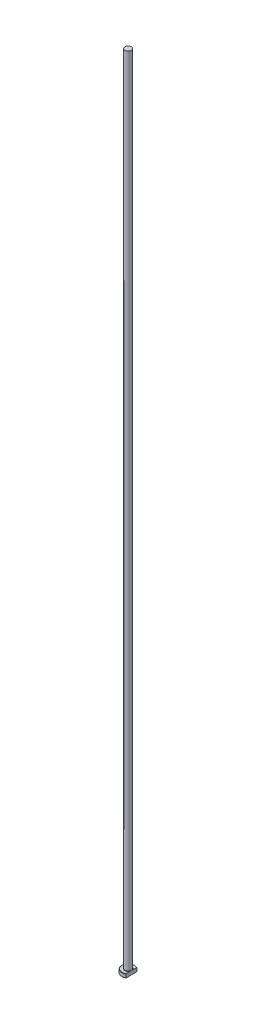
ISO-10303-21;
HEADER;
FILE_DESCRIPTION(('STEP AP214'),'2;1');
FILE_NAME('part.step','',(''),(''),'','','');
FILE_SCHEMA(('AUTOMOTIVE_DESIGN { 1 0 10303 214 1 1 1 1 }'));
ENDSEC;
DATA;
#1=APPLICATION_CONTEXT('core data for automotive mechanical design processes');
#2=APPLICATION_PROTOCOL_DEFINITION('international standard','automotive_design',2000,#1);
#3=PRODUCT_CONTEXT('',#1,'mechanical');
#4=PRODUCT('Part','Part','',(#3));
#5=PRODUCT_RELATED_PRODUCT_CATEGORY('part','',(#4));
#6=PRODUCT_DEFINITION_FORMATION('','',#4);
#7=PRODUCT_DEFINITION_CONTEXT('part definition',#1,'design');
#8=PRODUCT_DEFINITION('design','',#6,#7);
#9=PRODUCT_DEFINITION_SHAPE('','',#8);
#10=(LENGTH_UNIT() NAMED_UNIT(*) SI_UNIT(.MILLI.,.METRE.));
#11=(NAMED_UNIT(*) PLANE_ANGLE_UNIT() SI_UNIT($,.RADIAN.));
#12=(NAMED_UNIT(*) SI_UNIT($,.STERADIAN.) SOLID_ANGLE_UNIT());
#13=UNCERTAINTY_MEASURE_WITH_UNIT(LENGTH_MEASURE(1.E-05),#10,'distance_accuracy_value','');
#14=(GEOMETRIC_REPRESENTATION_CONTEXT(3) GLOBAL_UNCERTAINTY_ASSIGNED_CONTEXT((#13)) GLOBAL_UNIT_ASSIGNED_CONTEXT((#10,
#11,#12)) REPRESENTATION_CONTEXT('',''));
#15=CARTESIAN_POINT('',(0.,0.,0.));
#16=DIRECTION('',(0.,0.,1.));
#17=DIRECTION('',(1.,0.,0.));
#18=AXIS2_PLACEMENT_3D('',#15,#16,#17);
#19=CARTESIAN_POINT('',(0.,0.,0.));
#20=DIRECTION('',(0.,-1.,0.));
#21=DIRECTION('',(0.,0.,-1.));
#22=AXIS2_PLACEMENT_3D('',#19,#20,#21);
#23=PLANE('',#22);
#24=CARTESIAN_POINT('',(0.,0.,0.));
#25=DIRECTION('',(0.,-1.,0.));
#26=DIRECTION('',(0.,0.,-1.));
#27=AXIS2_PLACEMENT_3D('',#24,#25,#26);
#28=CIRCLE('',#27,4.79999999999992);
#29=CARTESIAN_POINT('',(2.49999999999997,0.,4.0975602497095));
#30=VERTEX_POINT('',#29);
#31=CARTESIAN_POINT('',(2.49999999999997,0.,-4.0975602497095));
#32=VERTEX_POINT('',#31);
#33=EDGE_CURVE('E98',#30,#32,#28,.T.);
#34=ORIENTED_EDGE('',*,*,#33,.T.);
#35=DIRECTION('',(0.,0.,1.));
#36=VECTOR('',#35,1.);
#37=CARTESIAN_POINT('',(2.49999999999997,0.,-4.33012701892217));
#38=LINE('',#37,#36);
#39=EDGE_CURVE('E83',#32,#30,#38,.T.);
#40=ORIENTED_EDGE('',*,*,#39,.T.);
#41=EDGE_LOOP('',(#34,#40));
#42=FACE_BOUND('',#41,.T.);
#43=ADVANCED_FACE('F32',(#42),#23,.T.);
#44=CARTESIAN_POINT('',(0.,259.958771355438,0.));
#45=DIRECTION('',(0.,1.,0.));
#46=DIRECTION('',(0.,0.,1.));
#47=AXIS2_PLACEMENT_3D('',#44,#45,#46);
#48=CYLINDRICAL_SURFACE('',#47,4.99999999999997);
#49=CARTESIAN_POINT('',(0.,2.79999999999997,0.));
#50=DIRECTION('',(0.,1.,0.));
#51=DIRECTION('',(0.,0.,1.));
#52=AXIS2_PLACEMENT_3D('',#49,#50,#51);
#53=CIRCLE('',#52,4.99999999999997);
#54=CARTESIAN_POINT('',(2.49999999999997,2.79999999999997,4.33012701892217));
#55=VERTEX_POINT('',#54);
#56=CARTESIAN_POINT('',(2.49999999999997,2.79999999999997,-4.33012701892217));
#57=VERTEX_POINT('',#56);
#58=EDGE_CURVE('E104',#55,#57,#53,.F.);
#59=ORIENTED_EDGE('',*,*,#58,.T.);
#60=DIRECTION('',(0.,-1.,0.));
#61=VECTOR('',#60,1.);
#62=CARTESIAN_POINT('',(2.49999999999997,630.,-4.33012701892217));
#63=LINE('',#62,#61);
#64=CARTESIAN_POINT('',(2.49999999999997,0.200000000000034,-4.33012701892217));
#65=VERTEX_POINT('',#64);
#66=EDGE_CURVE('E183',#57,#65,#63,.T.);
#67=ORIENTED_EDGE('',*,*,#66,.T.);
#68=CARTESIAN_POINT('',(0.,0.200000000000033,0.));
#69=DIRECTION('',(0.,-1.,0.));
#70=DIRECTION('',(0.,0.,-1.));
#71=AXIS2_PLACEMENT_3D('',#68,#69,#70);
#72=CIRCLE('',#71,4.99999999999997);
#73=CARTESIAN_POINT('',(2.49999999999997,0.200000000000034,4.33012701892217));
#74=VERTEX_POINT('',#73);
#75=EDGE_CURVE('E100',#65,#74,#72,.F.);
#76=ORIENTED_EDGE('',*,*,#75,.T.);
#77=DIRECTION('',(0.,-1.,0.));
#78=VECTOR('',#77,1.);
#79=CARTESIAN_POINT('',(2.49999999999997,630.,4.33012701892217));
#80=LINE('',#79,#78);
#81=EDGE_CURVE('E93',#55,#74,#80,.T.);
#82=ORIENTED_EDGE('',*,*,#81,.F.);
#83=EDGE_LOOP('',(#59,#67,#76,#82));
#84=FACE_BOUND('',#83,.T.);
#85=ADVANCED_FACE('F158',(#84),#48,.T.);
#86=CARTESIAN_POINT('',(-4.99999999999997,3.,0.));
#87=DIRECTION('',(0.,1.,0.));
#88=DIRECTION('',(0.,0.,1.));
#89=AXIS2_PLACEMENT_3D('',#86,#87,#88);
#90=PLANE('',#89);
#91=CARTESIAN_POINT('',(0.,3.,0.));
#92=DIRECTION('',(0.,1.,0.));
#93=DIRECTION('',(0.,0.,1.));
#94=AXIS2_PLACEMENT_3D('',#91,#92,#93);
#95=CIRCLE('',#94,4.79999999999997);
#96=CARTESIAN_POINT('',(2.49999999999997,3.,-4.09756024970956));
#97=VERTEX_POINT('',#96);
#98=CARTESIAN_POINT('',(2.49999999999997,3.,4.09756024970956));
#99=VERTEX_POINT('',#98);
#100=EDGE_CURVE('E178',#97,#99,#95,.T.);
#101=ORIENTED_EDGE('',*,*,#100,.T.);
#102=DIRECTION('',(0.,0.,-1.));
#103=VECTOR('',#102,1.);
#104=CARTESIAN_POINT('',(2.49999999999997,3.,0.));
#105=LINE('',#104,#103);
#106=CARTESIAN_POINT('',(2.49999999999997,2.99999999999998,1.01980390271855));
#107=VERTEX_POINT('',#106);
#108=EDGE_CURVE('E57',#99,#107,#105,.T.);
#109=ORIENTED_EDGE('',*,*,#108,.T.);
#110=CARTESIAN_POINT('',(0.,3.,0.));
#111=DIRECTION('',(0.,1.,0.));
#112=DIRECTION('',(0.,0.,1.));
#113=AXIS2_PLACEMENT_3D('',#110,#111,#112);
#114=CIRCLE('',#113,2.69999999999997);
#115=CARTESIAN_POINT('',(2.49999999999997,2.99999999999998,-1.01980390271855));
#116=VERTEX_POINT('',#115);
#117=EDGE_CURVE('E107',#107,#116,#114,.F.);
#118=ORIENTED_EDGE('',*,*,#117,.T.);
#119=EDGE_CURVE('E136',#116,#97,#105,.T.);
#120=ORIENTED_EDGE('',*,*,#119,.T.);
#121=EDGE_LOOP('',(#101,#109,#118,#120));
#122=FACE_BOUND('',#121,.T.);
#123=ADVANCED_FACE('F147',(#122),#90,.T.);
#124=CARTESIAN_POINT('',(0.,3.,0.));
#125=DIRECTION('',(0.,-1.,0.));
#126=DIRECTION('',(0.,0.,-1.));
#127=AXIS2_PLACEMENT_3D('',#124,#125,#126);
#128=CONICAL_SURFACE('',#127,4.79999999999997,0.785398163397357);
#129=ORIENTED_EDGE('',*,*,#58,.F.);
#130=CARTESIAN_POINT('',(2.49999999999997,-2.05039133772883,9.52786489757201));
#131=CARTESIAN_POINT('',(2.49999999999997,-1.84160367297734,9.31199733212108));
#132=CARTESIAN_POINT('',(2.49999999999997,-1.63304008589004,9.0959123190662));
#133=CARTESIAN_POINT('',(2.49999999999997,-1.21649358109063,8.66317810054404));
#134=CARTESIAN_POINT('',(2.49999999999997,-1.00851067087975,8.44652888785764));
#135=CARTESIAN_POINT('',(2.49999999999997,-0.593157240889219,8.01243155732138));
#136=CARTESIAN_POINT('',(2.49999999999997,-0.385787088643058,7.7949830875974));
#137=CARTESIAN_POINT('',(2.49999999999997,0.0280365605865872,7.35921771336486));
#138=CARTESIAN_POINT('',(2.49999999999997,0.234490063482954,7.1409008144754));
#139=CARTESIAN_POINT('',(2.49999999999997,0.642130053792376,6.70748960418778));
#140=CARTESIAN_POINT('',(2.49999999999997,0.843339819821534,6.49241720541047));
#141=CARTESIAN_POINT('',(2.49999999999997,1.24425381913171,6.06087422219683));
#142=CARTESIAN_POINT('',(2.49999999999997,1.44395806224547,5.84440364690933));
#143=CARTESIAN_POINT('',(2.49999999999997,1.84127751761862,5.40963663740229));
#144=CARTESIAN_POINT('',(2.49999999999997,2.03889317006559,5.19134060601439));
#145=CARTESIAN_POINT('',(2.49999999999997,2.43125043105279,4.7521850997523));
#146=CARTESIAN_POINT('',(2.49999999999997,2.6259921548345,4.53132572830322));
#147=CARTESIAN_POINT('',(2.49999999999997,2.93693788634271,4.17181619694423));
#148=CARTESIAN_POINT('',(2.49999999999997,3.05446493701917,4.03431188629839));
#149=CARTESIAN_POINT('',(2.49999999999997,3.28742704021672,3.75751486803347));
#150=CARTESIAN_POINT('',(2.49999999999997,3.40286188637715,3.6182219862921));
#151=CARTESIAN_POINT('',(2.49999999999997,3.63213234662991,3.33586492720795));
#152=CARTESIAN_POINT('',(2.49999999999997,3.74593818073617,3.19277645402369));
#153=CARTESIAN_POINT('',(2.49999999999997,3.96956266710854,2.90356071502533));
#154=CARTESIAN_POINT('',(2.49999999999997,4.079382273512,2.75743418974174));
#155=CARTESIAN_POINT('',(2.49999999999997,4.29502410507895,2.45881038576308));
#156=CARTESIAN_POINT('',(2.49999999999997,4.40076032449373,2.30625006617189));
#157=CARTESIAN_POINT('',(2.49999999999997,4.55286945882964,2.07299325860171));
#158=CARTESIAN_POINT('',(2.49999999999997,4.60252613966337,1.99444197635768));
#159=CARTESIAN_POINT('',(2.49999999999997,4.69908164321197,1.83566827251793));
#160=CARTESIAN_POINT('',(2.49999999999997,4.74598077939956,1.75544604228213));
#161=CARTESIAN_POINT('',(2.49999999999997,4.83578466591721,1.59405362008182));
#162=CARTESIAN_POINT('',(2.49999999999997,4.87873126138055,1.51290702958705));
#163=CARTESIAN_POINT('',(2.49999999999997,4.96038600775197,1.34852090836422));
#164=CARTESIAN_POINT('',(2.49999999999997,4.99909338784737,1.26528100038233));
#165=CARTESIAN_POINT('',(2.49999999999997,5.10703093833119,1.01251774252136));
#166=CARTESIAN_POINT('',(2.49999999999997,5.16843307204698,0.839342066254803));
#167=CARTESIAN_POINT('',(2.49999999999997,5.23490554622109,0.579703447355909));
#168=CARTESIAN_POINT('',(2.49999999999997,5.25253806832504,0.496421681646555));
#169=CARTESIAN_POINT('',(2.49999999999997,5.27986337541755,0.328535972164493));
#170=CARTESIAN_POINT('',(2.49999999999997,5.28955686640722,0.243932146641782));
#171=CARTESIAN_POINT('',(2.49999999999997,5.30031768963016,0.0744340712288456));
#172=CARTESIAN_POINT('',(2.49999999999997,5.30141176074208,-0.010458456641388));
#173=CARTESIAN_POINT('',(2.49999999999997,5.29496530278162,-0.179916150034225));
#174=CARTESIAN_POINT('',(2.49999999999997,5.28742406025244,-0.26448128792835));
#175=CARTESIAN_POINT('',(2.49999999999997,5.2643342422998,-0.431754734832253));
#176=CARTESIAN_POINT('',(2.49999999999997,5.24885436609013,-0.514472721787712));
#177=CARTESIAN_POINT('',(2.49999999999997,5.21085318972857,-0.678257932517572));
#178=CARTESIAN_POINT('',(2.49999999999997,5.18833104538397,-0.759324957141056));
#179=CARTESIAN_POINT('',(2.49999999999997,5.13718929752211,-0.920001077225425));
#180=CARTESIAN_POINT('',(2.49999999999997,5.10853534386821,-0.999599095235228));
#181=CARTESIAN_POINT('',(2.49999999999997,5.04628092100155,-1.15679278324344));
#182=CARTESIAN_POINT('',(2.49999999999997,5.01268146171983,-1.234388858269));
#183=CARTESIAN_POINT('',(2.49999999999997,4.90558195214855,-1.46503672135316));
#184=CARTESIAN_POINT('',(2.49999999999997,4.82601567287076,-1.61526350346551));
#185=CARTESIAN_POINT('',(2.49999999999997,4.65635232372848,-1.90970759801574));
#186=CARTESIAN_POINT('',(2.49999999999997,4.56624199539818,-2.0539170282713));
#187=CARTESIAN_POINT('',(2.49999999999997,4.37862201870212,-2.33821627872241));
#188=CARTESIAN_POINT('',(2.49999999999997,4.28108460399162,-2.47828761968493));
#189=CARTESIAN_POINT('',(2.49999999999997,4.08116271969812,-2.75478641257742));
#190=CARTESIAN_POINT('',(2.49999999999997,3.97878070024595,-2.89121565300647));
#191=CARTESIAN_POINT('',(2.49999999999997,3.76913910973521,-3.16313520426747));
#192=CARTESIAN_POINT('',(2.49999999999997,3.66183307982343,-3.29858952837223));
#193=CARTESIAN_POINT('',(2.49999999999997,3.44456217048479,-3.5673642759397));
#194=CARTESIAN_POINT('',(2.49999999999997,3.33459700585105,-3.70068446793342));
#195=CARTESIAN_POINT('',(2.49999999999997,3.1129346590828,-3.96532340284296));
#196=CARTESIAN_POINT('',(2.49999999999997,3.00124232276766,-4.0966462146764));
#197=CARTESIAN_POINT('',(2.49999999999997,2.7763127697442,-4.35796341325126));
#198=CARTESIAN_POINT('',(2.49999999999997,2.66307552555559,-4.48795777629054));
#199=CARTESIAN_POINT('',(2.49999999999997,2.36028773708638,-4.83228553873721));
#200=CARTESIAN_POINT('',(2.49999999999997,2.16967435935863,-5.04568363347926));
#201=CARTESIAN_POINT('',(2.49999999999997,1.78611780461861,-5.47037913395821));
#202=CARTESIAN_POINT('',(2.49999999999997,1.59317456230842,-5.68167648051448));
#203=CARTESIAN_POINT('',(2.49999999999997,1.20540648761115,-6.10290357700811));
#204=CARTESIAN_POINT('',(2.49999999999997,1.01058005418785,-6.31283185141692));
#205=CARTESIAN_POINT('',(2.49999999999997,0.619649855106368,-6.73149551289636));
#206=CARTESIAN_POINT('',(2.49999999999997,0.423546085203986,-6.94023089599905));
#207=CARTESIAN_POINT('',(2.49999999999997,0.0384434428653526,-7.34820392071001));
#208=CARTESIAN_POINT('',(2.49999999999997,-0.150515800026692,-7.5474789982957));
#209=CARTESIAN_POINT('',(2.49999999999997,-0.529153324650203,-7.94534601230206));
#210=CARTESIAN_POINT('',(2.49999999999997,-0.718831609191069,-8.1439379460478));
#211=CARTESIAN_POINT('',(2.49999999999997,-1.0985546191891,-8.54034636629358));
#212=CARTESIAN_POINT('',(2.49999999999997,-1.28859869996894,-8.73816347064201));
#213=CARTESIAN_POINT('',(2.49999999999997,-1.6691626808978,-9.13333639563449));
#214=CARTESIAN_POINT('',(2.49999999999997,-1.85968257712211,-9.33069222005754));
#215=CARTESIAN_POINT('',(2.49999999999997,-2.05039133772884,-9.52786489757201));
#216=B_SPLINE_CURVE_WITH_KNOTS('',3,(#130,#131,#132,#133,#134,#135,#136,#137,#138,#139,#140,
#141,#142,#143,#144,#145,#146,#147,#148,#149,#150,#151,#152,#153,#154,#155,#156,#157,#158,#159,
#160,#161,#162,#163,#164,#165,#166,#167,#168,#169,#170,#171,#172,#173,#174,#175,#176,#177,#178,
#179,#180,#181,#182,#183,#184,#185,#186,#187,#188,#189,#190,#191,#192,#193,#194,#195,#196,#197,
#198,#199,#200,#201,#202,#203,#204,#205,#206,#207,#208,#209,#210,#211,#212,#213,#214,#215),
.UNSPECIFIED.,.F.,.F.,(4,2,2,2,2,2,2,2,2,2,2,2,2,2,2,2,2,2,2,2,2,2,2,2,2,2,2,2,2,2,2,2,2,2,2,2,
2,2,2,2,2,2,4),(0.,0.900955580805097,1.80192274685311,2.70335062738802,3.60477268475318,
4.4883248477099,5.37187123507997,6.25522753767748,7.13854832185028,7.68119321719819,
8.22389134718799,8.77232299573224,9.32062249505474,9.87724663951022,10.1559936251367,
10.4347088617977,10.7100145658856,10.9853702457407,11.5339745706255,11.7890461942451,
12.0440951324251,12.298350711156,12.5526272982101,12.8047396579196,13.0568822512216,
13.3104761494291,13.5640183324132,14.0732618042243,14.5831526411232,15.0950533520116,
15.6066978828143,16.1250759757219,16.6435099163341,17.1606868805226,17.6778730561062,
18.5362451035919,19.3946412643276,20.2538459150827,21.1130534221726,21.9369112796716,
22.7607723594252,23.5837145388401,24.4066499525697),.UNSPECIFIED.);
#217=EDGE_CURVE('E135',#55,#99,#216,.T.);
#218=ORIENTED_EDGE('',*,*,#217,.T.);
#219=ORIENTED_EDGE('',*,*,#100,.F.);
#220=EDGE_CURVE('E127',#97,#57,#216,.T.);
#221=ORIENTED_EDGE('',*,*,#220,.T.);
#222=EDGE_LOOP('',(#129,#218,#219,#221));
#223=FACE_BOUND('',#222,.T.);
#224=ADVANCED_FACE('F143',(#223),#128,.T.);
#225=CARTESIAN_POINT('',(0.,0.200000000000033,0.));
#226=DIRECTION('',(0.,1.,0.));
#227=DIRECTION('',(0.,0.,1.));
#228=AXIS2_PLACEMENT_3D('',#225,#226,#227);
#229=CONICAL_SURFACE('',#228,4.99999999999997,0.785398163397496);
#230=ORIENTED_EDGE('',*,*,#75,.F.);
#231=CARTESIAN_POINT('',(2.49999999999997,5.05039133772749,-9.52786489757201));
#232=CARTESIAN_POINT('',(2.49999999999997,4.8416036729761,-9.31199733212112));
#233=CARTESIAN_POINT('',(2.49999999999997,4.63304008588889,-9.09591231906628));
#234=CARTESIAN_POINT('',(2.49999999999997,4.21649358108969,-8.66317810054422));
#235=CARTESIAN_POINT('',(2.49999999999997,4.00851067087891,-8.44652888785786));
#236=CARTESIAN_POINT('',(2.49999999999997,3.59315724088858,-8.01243155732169));
#237=CARTESIAN_POINT('',(2.49999999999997,3.38578708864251,-7.79498308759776));
#238=CARTESIAN_POINT('',(2.49999999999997,2.97196343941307,-7.3592177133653));
#239=CARTESIAN_POINT('',(2.49999999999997,2.7655099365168,-7.14090081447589));
#240=CARTESIAN_POINT('',(2.49999999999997,2.35786994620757,-6.70748960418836));
#241=CARTESIAN_POINT('',(2.49999999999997,2.1566601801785,-6.49241720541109));
#242=CARTESIAN_POINT('',(2.49999999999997,1.75574618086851,-6.06087422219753));
#243=CARTESIAN_POINT('',(2.49999999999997,1.55604193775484,-5.84440364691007));
#244=CARTESIAN_POINT('',(2.49999999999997,1.15872248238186,-5.40963663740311));
#245=CARTESIAN_POINT('',(2.49999999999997,0.961106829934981,-5.19134060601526));
#246=CARTESIAN_POINT('',(2.49999999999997,0.568749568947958,-4.75218509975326));
#247=CARTESIAN_POINT('',(2.49999999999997,0.374007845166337,-4.53132572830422));
#248=CARTESIAN_POINT('',(2.49999999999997,0.0630621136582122,-4.17181619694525));
#249=CARTESIAN_POINT('',(2.49999999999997,-0.0544649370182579,-4.03431188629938));
#250=CARTESIAN_POINT('',(2.49999999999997,-0.287427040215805,-3.7575148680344));
#251=CARTESIAN_POINT('',(2.49999999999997,-0.402861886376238,-3.618221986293));
#252=CARTESIAN_POINT('',(2.49999999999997,-0.632132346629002,-3.3358649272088));
#253=CARTESIAN_POINT('',(2.49999999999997,-0.745938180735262,-3.1927764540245));
#254=CARTESIAN_POINT('',(2.49999999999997,-0.969562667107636,-2.90356071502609));
#255=CARTESIAN_POINT('',(2.49999999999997,-1.0793822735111,-2.75743418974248));
#256=CARTESIAN_POINT('',(2.49999999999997,-1.29502410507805,-2.45881038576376));
#257=CARTESIAN_POINT('',(2.49999999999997,-1.40076032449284,-2.30625006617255));
#258=CARTESIAN_POINT('',(2.49999999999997,-1.55286945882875,-2.07299325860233));
#259=CARTESIAN_POINT('',(2.49999999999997,-1.60252613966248,-1.9944419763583));
#260=CARTESIAN_POINT('',(2.49999999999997,-1.69908164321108,-1.83566827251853));
#261=CARTESIAN_POINT('',(2.49999999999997,-1.74598077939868,-1.75544604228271));
#262=CARTESIAN_POINT('',(2.49999999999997,-1.83578466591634,-1.59405362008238));
#263=CARTESIAN_POINT('',(2.49999999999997,-1.87873126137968,-1.5129070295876));
#264=CARTESIAN_POINT('',(2.49999999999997,-1.96038600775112,-1.34852090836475));
#265=CARTESIAN_POINT('',(2.49999999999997,-1.99909338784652,-1.26528100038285));
#266=CARTESIAN_POINT('',(2.49999999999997,-2.10703093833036,-1.01251774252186));
#267=CARTESIAN_POINT('',(2.49999999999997,-2.16843307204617,-0.839342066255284));
#268=CARTESIAN_POINT('',(2.49999999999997,-2.23490554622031,-0.57970344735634));
#269=CARTESIAN_POINT('',(2.49999999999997,-2.25253806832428,-0.496421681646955));
#270=CARTESIAN_POINT('',(2.49999999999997,-2.27986337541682,-0.328535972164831));
#271=CARTESIAN_POINT('',(2.49999999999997,-2.2895568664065,-0.243932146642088));
#272=CARTESIAN_POINT('',(2.49999999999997,-2.30031768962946,-0.0744340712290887));
#273=CARTESIAN_POINT('',(2.49999999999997,-2.30141176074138,0.0104584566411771));
#274=CARTESIAN_POINT('',(2.49999999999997,-2.29496530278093,0.179916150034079));
#275=CARTESIAN_POINT('',(2.49999999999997,-2.28742406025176,0.264481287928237));
#276=CARTESIAN_POINT('',(2.49999999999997,-2.26433424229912,0.431754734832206));
#277=CARTESIAN_POINT('',(2.49999999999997,-2.24885436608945,0.514472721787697));
#278=CARTESIAN_POINT('',(2.49999999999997,-2.21085318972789,0.678257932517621));
#279=CARTESIAN_POINT('',(2.49999999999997,-2.18833104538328,0.759324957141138));
#280=CARTESIAN_POINT('',(2.49999999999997,-2.13718929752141,0.920001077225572));
#281=CARTESIAN_POINT('',(2.49999999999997,-2.1085353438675,0.999599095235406));
#282=CARTESIAN_POINT('',(2.49999999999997,-2.04628092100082,1.15679278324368));
#283=CARTESIAN_POINT('',(2.49999999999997,-2.01268146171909,1.23438885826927));
#284=CARTESIAN_POINT('',(2.49999999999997,-1.90558195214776,1.46503672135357));
#285=CARTESIAN_POINT('',(2.49999999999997,-1.82601567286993,1.61526350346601));
#286=CARTESIAN_POINT('',(2.49999999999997,-1.65635232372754,1.90970759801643));
#287=CARTESIAN_POINT('',(2.49999999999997,-1.56624199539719,2.05391702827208));
#288=CARTESIAN_POINT('',(2.49999999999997,-1.37862201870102,2.33821627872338));
#289=CARTESIAN_POINT('',(2.49999999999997,-1.28108460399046,2.47828761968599));
#290=CARTESIAN_POINT('',(2.49999999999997,-1.08116271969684,2.75478641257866));
#291=CARTESIAN_POINT('',(2.49999999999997,-0.978780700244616,2.8912156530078));
#292=CARTESIAN_POINT('',(2.49999999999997,-0.769139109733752,3.16313520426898));
#293=CARTESIAN_POINT('',(2.49999999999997,-0.661833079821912,3.29858952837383));
#294=CARTESIAN_POINT('',(2.49999999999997,-0.444562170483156,3.56736427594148));
#295=CARTESIAN_POINT('',(2.49999999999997,-0.334597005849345,3.70068446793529));
#296=CARTESIAN_POINT('',(2.49999999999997,-0.112934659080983,3.965323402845));
#297=CARTESIAN_POINT('',(2.49999999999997,-0.00124232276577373,4.09664621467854));
#298=CARTESIAN_POINT('',(2.49999999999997,0.223687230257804,4.35796341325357));
#299=CARTESIAN_POINT('',(2.49999999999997,0.336924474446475,4.48795777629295));
#300=CARTESIAN_POINT('',(2.49999999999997,0.639712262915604,4.83228553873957));
#301=CARTESIAN_POINT('',(2.49999999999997,0.830325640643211,5.04568363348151));
#302=CARTESIAN_POINT('',(2.49999999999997,1.21388219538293,5.47037913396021));
#303=CARTESIAN_POINT('',(2.49999999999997,1.40682543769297,5.68167648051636));
#304=CARTESIAN_POINT('',(2.49999999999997,1.79459351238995,6.10290357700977));
#305=CARTESIAN_POINT('',(2.49999999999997,1.98941994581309,6.31283185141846));
#306=CARTESIAN_POINT('',(2.49999999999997,2.38035014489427,6.73149551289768));
#307=CARTESIAN_POINT('',(2.49999999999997,2.57645391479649,6.94023089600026));
#308=CARTESIAN_POINT('',(2.49999999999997,2.96155655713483,7.34820392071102));
#309=CARTESIAN_POINT('',(2.49999999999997,3.15051580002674,7.54747899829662));
#310=CARTESIAN_POINT('',(2.49999999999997,3.52915332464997,7.94534601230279));
#311=CARTESIAN_POINT('',(2.49999999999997,3.7188316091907,8.14393794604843));
#312=CARTESIAN_POINT('',(2.49999999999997,4.09855461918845,8.54034636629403));
#313=CARTESIAN_POINT('',(2.49999999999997,4.28859869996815,8.73816347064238));
#314=CARTESIAN_POINT('',(2.49999999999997,4.66916268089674,9.13333639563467));
#315=CARTESIAN_POINT('',(2.49999999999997,4.85968257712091,9.33069222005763));
#316=CARTESIAN_POINT('',(2.49999999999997,5.05039133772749,9.527864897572));
#317=B_SPLINE_CURVE_WITH_KNOTS('',3,(#231,#232,#233,#234,#235,#236,#237,#238,#239,#240,#241,
#242,#243,#244,#245,#246,#247,#248,#249,#250,#251,#252,#253,#254,#255,#256,#257,#258,#259,#260,
#261,#262,#263,#264,#265,#266,#267,#268,#269,#270,#271,#272,#273,#274,#275,#276,#277,#278,#279,
#280,#281,#282,#283,#284,#285,#286,#287,#288,#289,#290,#291,#292,#293,#294,#295,#296,#297,#298,
#299,#300,#301,#302,#303,#304,#305,#306,#307,#308,#309,#310,#311,#312,#313,#314,#315,#316),
.UNSPECIFIED.,.F.,.F.,(4,2,2,2,2,2,2,2,2,2,2,2,2,2,2,2,2,2,2,2,2,2,2,2,2,2,2,2,2,2,2,2,2,2,2,2,
2,2,2,2,2,2,4),(0.,0.900955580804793,1.8019227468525,2.70335062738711,3.60477268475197,
4.48832484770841,5.3718712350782,6.25522753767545,7.13854832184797,7.68119321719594,
8.22389134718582,8.77232299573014,9.3206224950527,9.87724663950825,10.1559936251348,
10.4347088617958,10.7100145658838,10.9853702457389,11.5339745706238,11.7890461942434,
12.0440951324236,12.2983507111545,12.5526272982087,12.8047396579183,13.0568822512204,
13.310476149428,13.5640183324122,14.0732618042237,14.5831526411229,15.0950533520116,
15.6066978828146,16.1250759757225,16.643509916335,17.1606868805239,17.6778730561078,
18.5362451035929,19.3946412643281,20.2538459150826,21.113053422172,21.9369112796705,
22.7607723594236,23.583714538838,24.4066499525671),.UNSPECIFIED.);
#318=EDGE_CURVE('E86',#65,#32,#317,.T.);
#319=ORIENTED_EDGE('',*,*,#318,.T.);
#320=ORIENTED_EDGE('',*,*,#33,.F.);
#321=EDGE_CURVE('E89',#30,#74,#317,.T.);
#322=ORIENTED_EDGE('',*,*,#321,.T.);
#323=EDGE_LOOP('',(#230,#319,#320,#322));
#324=FACE_BOUND('',#323,.T.);
#325=ADVANCED_FACE('F97',(#324),#229,.T.);
#326=CARTESIAN_POINT('',(0.,3.19999999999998,0.));
#327=DIRECTION('',(0.,1.,0.));
#328=DIRECTION('',(0.,0.,1.));
#329=AXIS2_PLACEMENT_3D('',#326,#327,#328);
#330=TOROIDAL_SURFACE('',#329,2.69999999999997,0.2);
#331=CARTESIAN_POINT('',(2.49999999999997,3.19999999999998,0.));
#332=CARTESIAN_POINT('',(2.49999999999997,3.20000050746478,5.29061312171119E-11));
#333=CARTESIAN_POINT('',(2.49999999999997,3.20000101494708,-1.70517157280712E-07));
#334=CARTESIAN_POINT('',(2.49999999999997,3.20000196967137,-6.59443804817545E-07));
#335=CARTESIAN_POINT('',(2.49999999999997,3.20000240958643,-9.87883924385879E-07));
#336=CARTESIAN_POINT('',(2.49999999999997,3.20000331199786,-1.7724689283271E-06));
#337=CARTESIAN_POINT('',(2.49999999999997,3.20000376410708,-2.24097229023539E-06));
#338=CARTESIAN_POINT('',(2.49999999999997,3.20000458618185,-3.2218605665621E-06));
#339=CARTESIAN_POINT('',(2.49999999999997,3.20000495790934,-3.73286586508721E-06));
#340=CARTESIAN_POINT('',(2.49999999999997,3.20000630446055,-5.67453781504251E-06));
#341=CARTESIAN_POINT('',(2.49999999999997,3.20000720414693,-7.15943624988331E-06));
#342=CARTESIAN_POINT('',(2.49999999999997,3.20000871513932,-1.01304383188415E-05));
#343=CARTESIAN_POINT('',(2.49999999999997,3.20000934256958,-1.16087237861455E-05));
#344=CARTESIAN_POINT('',(2.49999999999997,3.20001191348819,-1.77555555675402E-05));
#345=CARTESIAN_POINT('',(2.49999999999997,3.20001378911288,-2.24564506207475E-05));
#346=CARTESIAN_POINT('',(2.49999999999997,3.20001661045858,-3.14167101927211E-05));
#347=CARTESIAN_POINT('',(2.49999999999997,3.20001764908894,-3.56468503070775E-05));
#348=CARTESIAN_POINT('',(2.49999999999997,3.20002511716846,-6.67543462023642E-05));
#349=CARTESIAN_POINT('',(2.49999999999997,3.20003067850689,-9.37930225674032E-05));
#350=CARTESIAN_POINT('',(2.49999999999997,3.20005501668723,-0.000200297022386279));
#351=CARTESIAN_POINT('',(2.49999999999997,3.20007833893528,-0.000278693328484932));
#352=CARTESIAN_POINT('',(2.49999999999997,3.20016883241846,-0.000588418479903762));
#353=CARTESIAN_POINT('',(2.49999999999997,3.2002329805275,-0.000820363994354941));
#354=CARTESIAN_POINT('',(2.49999999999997,3.20048923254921,-0.00173961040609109));
#355=CARTESIAN_POINT('',(2.49999999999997,3.20068508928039,-0.00242612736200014));
#356=CARTESIAN_POINT('',(2.49999999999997,3.201497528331,-0.00528196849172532));
#357=CARTESIAN_POINT('',(2.49999999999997,3.20210941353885,-0.0074522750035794));
#358=CARTESIAN_POINT('',(2.49999999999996,3.20774599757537,-0.0274346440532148));
#359=CARTESIAN_POINT('',(2.49999999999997,3.21279017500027,-0.0452427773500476));
#360=CARTESIAN_POINT('',(2.49999999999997,3.22264347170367,-0.080167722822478));
#361=CARTESIAN_POINT('',(2.49999999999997,3.22745402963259,-0.0972841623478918));
#362=CARTESIAN_POINT('',(2.49999999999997,3.23763483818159,-0.133672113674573));
#363=CARTESIAN_POINT('',(2.49999999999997,3.24299975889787,-0.15294514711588));
#364=CARTESIAN_POINT('',(2.49999999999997,3.25370389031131,-0.191722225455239));
#365=CARTESIAN_POINT('',(2.49999999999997,3.25904219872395,-0.211226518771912));
#366=CARTESIAN_POINT('',(2.49999999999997,3.27184445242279,-0.258540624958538));
#367=CARTESIAN_POINT('',(2.49999999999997,3.27925018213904,-0.286366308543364));
#368=CARTESIAN_POINT('',(2.49999999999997,3.29355148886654,-0.341371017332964));
#369=CARTESIAN_POINT('',(2.49999999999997,3.30045534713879,-0.368547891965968));
#370=CARTESIAN_POINT('',(2.49999999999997,3.31991129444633,-0.447507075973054));
#371=CARTESIAN_POINT('',(2.49999999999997,3.33195369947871,-0.499417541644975));
#372=CARTESIAN_POINT('',(2.49999999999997,3.35404241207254,-0.60418810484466));
#373=CARTESIAN_POINT('',(2.49999999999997,3.36406867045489,-0.657052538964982));
#374=CARTESIAN_POINT('',(2.49999999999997,3.38176575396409,-0.767598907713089));
#375=CARTESIAN_POINT('',(2.49999999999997,3.38917909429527,-0.825323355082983));
#376=CARTESIAN_POINT('',(2.49999999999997,3.39884096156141,-0.94105511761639));
#377=CARTESIAN_POINT('',(2.49999999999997,3.40111055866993,-0.999060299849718));
#378=CARTESIAN_POINT('',(2.49999999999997,3.39847691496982,-1.09324578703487));
#379=CARTESIAN_POINT('',(2.49999999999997,3.39593644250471,-1.12948454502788));
#380=CARTESIAN_POINT('',(2.49999999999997,3.38674319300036,-1.20096926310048));
#381=CARTESIAN_POINT('',(2.49999999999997,3.38015410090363,-1.2362219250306));
#382=CARTESIAN_POINT('',(2.49999999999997,3.36639936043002,-1.28579148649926));
#383=CARTESIAN_POINT('',(2.49999999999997,3.36162670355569,-1.30076836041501));
#384=CARTESIAN_POINT('',(2.49999999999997,3.35062798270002,-1.33028325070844));
#385=CARTESIAN_POINT('',(2.49999999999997,3.34439458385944,-1.34481861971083));
#386=CARTESIAN_POINT('',(2.49999999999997,3.33003808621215,-1.37319413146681));
#387=CARTESIAN_POINT('',(2.49999999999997,3.32189015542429,-1.38702194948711));
#388=CARTESIAN_POINT('',(2.49999999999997,3.30325367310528,-1.4129811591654));
#389=CARTESIAN_POINT('',(2.49999999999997,3.2927824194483,-1.42512406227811));
#390=CARTESIAN_POINT('',(2.49999999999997,3.27569207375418,-1.44029611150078));
#391=CARTESIAN_POINT('',(2.49999999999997,3.27021837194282,-1.4446101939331));
#392=CARTESIAN_POINT('',(2.49999999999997,3.25870897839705,-1.45242709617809));
#393=CARTESIAN_POINT('',(2.49999999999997,3.25267333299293,-1.45592998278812));
#394=CARTESIAN_POINT('',(2.49999999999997,3.24001938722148,-1.46191450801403));
#395=CARTESIAN_POINT('',(2.49999999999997,3.233395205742,-1.46438399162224));
#396=CARTESIAN_POINT('',(2.49999999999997,3.21979347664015,-1.46798853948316));
#397=CARTESIAN_POINT('',(2.49999999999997,3.21281651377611,-1.46912574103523));
#398=CARTESIAN_POINT('',(2.49999999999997,3.19961348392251,-1.46988240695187));
#399=CARTESIAN_POINT('',(2.49999999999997,3.19339654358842,-1.46966594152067));
#400=CARTESIAN_POINT('',(2.49999999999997,3.18110362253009,-1.46811597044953));
#401=CARTESIAN_POINT('',(2.49999999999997,3.17502769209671,-1.46678207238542));
#402=CARTESIAN_POINT('',(2.49999999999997,3.16354702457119,-1.46323301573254));
#403=CARTESIAN_POINT('',(2.49999999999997,3.15812390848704,-1.46107586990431));
#404=CARTESIAN_POINT('',(2.49999999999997,3.14763458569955,-1.45603007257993));
#405=CARTESIAN_POINT('',(2.49999999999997,3.14256845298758,-1.45314127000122));
#406=CARTESIAN_POINT('',(2.49999999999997,3.12963191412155,-1.44468844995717));
#407=CARTESIAN_POINT('',(2.49999999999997,3.12209714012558,-1.43861122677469));
#408=CARTESIAN_POINT('',(2.49999999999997,3.10805350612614,-1.42536327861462));
#409=CARTESIAN_POINT('',(2.49999999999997,3.10154826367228,-1.418188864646));
#410=CARTESIAN_POINT('',(2.49999999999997,3.08513615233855,-1.39772885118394));
#411=CARTESIAN_POINT('',(2.49999999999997,3.07611692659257,-1.38373739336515));
#412=CARTESIAN_POINT('',(2.49999999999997,3.06018433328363,-1.35465370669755));
#413=CARTESIAN_POINT('',(2.49999999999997,3.0532724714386,-1.33956070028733));
#414=CARTESIAN_POINT('',(2.49999999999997,3.04107204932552,-1.30868385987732));
#415=CARTESIAN_POINT('',(2.49999999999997,3.03578911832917,-1.29289784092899));
#416=CARTESIAN_POINT('',(2.49999999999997,3.02655583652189,-1.26093375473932));
#417=CARTESIAN_POINT('',(2.49999999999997,3.0226069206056,-1.24475528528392));
#418=CARTESIAN_POINT('',(2.49999999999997,3.01232854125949,-1.19551094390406));
#419=CARTESIAN_POINT('',(2.49999999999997,3.00769429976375,-1.16209442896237));
#420=CARTESIAN_POINT('',(2.49999999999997,3.00005311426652,-1.07761506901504));
#421=CARTESIAN_POINT('',(2.49999999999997,2.99913690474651,-1.02638928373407));
#422=CARTESIAN_POINT('',(2.49999999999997,3.00223345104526,-0.923947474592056));
#423=CARTESIAN_POINT('',(2.49999999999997,3.00626667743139,-0.872732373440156));
#424=CARTESIAN_POINT('',(2.49999999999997,3.01749958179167,-0.773934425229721));
#425=CARTESIAN_POINT('',(2.49999999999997,3.02448410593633,-0.72632575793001));
#426=CARTESIAN_POINT('',(2.49999999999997,3.04066526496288,-0.631906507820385));
#427=CARTESIAN_POINT('',(2.49999999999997,3.0498429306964,-0.585092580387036));
#428=CARTESIAN_POINT('',(2.49999999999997,3.06791405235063,-0.500780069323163));
#429=CARTESIAN_POINT('',(2.49999999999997,3.07652349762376,-0.463219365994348));
#430=CARTESIAN_POINT('',(2.49999999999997,3.09478102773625,-0.387318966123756));
#431=CARTESIAN_POINT('',(2.49999999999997,3.10445029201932,-0.348984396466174));
#432=CARTESIAN_POINT('',(2.49999999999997,3.12135487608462,-0.284095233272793));
#433=CARTESIAN_POINT('',(2.49999999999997,3.12843710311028,-0.257500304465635));
#434=CARTESIAN_POINT('',(2.49999999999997,3.14273562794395,-0.204655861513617));
#435=CARTESIAN_POINT('',(2.49999999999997,3.1499496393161,-0.178405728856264));
#436=CARTESIAN_POINT('',(2.49999999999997,3.1636921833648,-0.128877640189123));
#437=CARTESIAN_POINT('',(2.49999999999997,3.17020707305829,-0.10559584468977));
#438=CARTESIAN_POINT('',(2.49999999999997,3.18358099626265,-0.0580847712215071));
#439=CARTESIAN_POINT('',(2.49999999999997,3.19044308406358,-0.033856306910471));
#440=CARTESIAN_POINT('',(2.49999999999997,3.19789108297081,-0.00745034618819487));
#441=CARTESIAN_POINT('',(2.49999999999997,3.198503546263,-0.00527812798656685));
#442=CARTESIAN_POINT('',(2.49999999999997,3.1993161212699,-0.0024218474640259));
#443=CARTESIAN_POINT('',(2.49999999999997,3.19951155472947,-0.00173680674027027));
#444=CARTESIAN_POINT('',(2.49999999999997,3.19976729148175,-0.000819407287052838));
#445=CARTESIAN_POINT('',(2.49999999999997,3.19983133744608,-0.00058783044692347));
#446=CARTESIAN_POINT('',(2.49999999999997,3.19992170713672,-0.000278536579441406));
#447=CARTESIAN_POINT('',(2.49999999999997,3.19994501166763,-0.000200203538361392));
#448=CARTESIAN_POINT('',(2.49999999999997,3.19996933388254,-9.3772760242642E-05));
#449=CARTESIAN_POINT('',(2.49999999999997,3.19997489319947,-6.67431741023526E-05));
#450=CARTESIAN_POINT('',(2.49999999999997,3.1999823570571,-3.56449049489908E-05));
#451=CARTESIAN_POINT('',(2.49999999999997,3.19998339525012,-3.14152905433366E-05));
#452=CARTESIAN_POINT('',(2.49999999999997,3.19998621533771,-2.24560901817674E-05));
#453=CARTESIAN_POINT('',(2.49999999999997,3.19998809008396,-1.77557009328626E-05));
#454=CARTESIAN_POINT('',(2.49999999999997,3.19999065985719,-1.16093871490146E-05));
#455=CARTESIAN_POINT('',(2.49999999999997,3.1999912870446,-1.01311410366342E-05));
#456=CARTESIAN_POINT('',(2.49999999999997,3.19999279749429,-7.16017592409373E-06));
#457=CARTESIAN_POINT('',(2.49999999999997,3.19999369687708,-5.67527054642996E-06));
#458=CARTESIAN_POINT('',(2.49999999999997,3.19999504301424,-3.73354014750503E-06));
#459=CARTESIAN_POINT('',(2.49999999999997,3.19999541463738,-3.22250653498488E-06));
#460=CARTESIAN_POINT('',(2.49999999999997,3.19999623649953,-2.24154280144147E-06));
#461=CARTESIAN_POINT('',(2.49999999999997,3.19999668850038,-1.77299174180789E-06));
#462=CARTESIAN_POINT('',(2.49999999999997,3.19999759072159,-9.88293774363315E-07));
#463=CARTESIAN_POINT('',(2.49999999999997,3.19999803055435,-6.59792278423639E-07));
#464=CARTESIAN_POINT('',(2.49999999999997,3.19999898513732,-1.7071215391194E-07));
#465=CARTESIAN_POINT('',(2.49999999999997,3.1999994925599,-5.29035539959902E-11));
#466=CARTESIAN_POINT('',(2.49999999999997,3.19999999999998,0.));
#467=B_SPLINE_CURVE_WITH_KNOTS('',3,(#331,#332,#333,#334,#335,#336,#337,#338,#339,#340,#341,
#342,#343,#344,#345,#346,#347,#348,#349,#350,#351,#352,#353,#354,#355,#356,#357,#358,#359,#360,
#361,#362,#363,#364,#365,#366,#367,#368,#369,#370,#371,#372,#373,#374,#375,#376,#377,#378,#379,
#380,#381,#382,#383,#384,#385,#386,#387,#388,#389,#390,#391,#392,#393,#394,#395,#396,#397,#398,
#399,#400,#401,#402,#403,#404,#405,#406,#407,#408,#409,#410,#411,#412,#413,#414,#415,#416,#417,
#418,#419,#420,#421,#422,#423,#424,#425,#426,#427,#428,#429,#430,#431,#432,#433,#434,#435,#436,
#437,#438,#439,#440,#441,#442,#443,#444,#445,#446,#447,#448,#449,#450,#451,#452,#453,#454,#455,
#456,#457,#458,#459,#460,#461,#462,#463,#464,#465,#466),.UNSPECIFIED.,.T.,.F.,(4,2,2,2,2,2,2,2,
2,2,2,2,2,2,2,2,2,2,2,2,2,2,2,2,2,2,2,2,2,2,2,2,2,2,2,2,2,2,2,2,2,2,2,2,2,2,2,2,2,2,2,2,2,2,2,2,
2,2,2,2,2,2,2,2,2,2,2,4),(0.,1.53002989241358E-06,3.17429895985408E-06,5.11692917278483E-06,
7.01128942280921E-06,1.21993179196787E-05,1.70129966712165E-05,3.21659460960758E-05,
4.52166487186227E-05,0.000128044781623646,0.000373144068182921,0.00109538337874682,
0.00323676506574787,0.0100018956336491,0.0655261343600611,0.118865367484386,0.178882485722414,
0.239547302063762,0.325928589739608,0.410047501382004,0.56988542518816,0.731241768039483,
0.905704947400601,1.07945217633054,1.18829443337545,1.2954669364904,1.34257193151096,
1.38991872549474,1.43791728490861,1.4855698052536,1.50642342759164,1.52727533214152,
1.54836603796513,1.56942286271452,1.58798129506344,1.60654624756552,1.62399133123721,
1.64144002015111,1.67031274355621,1.69928476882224,1.74894310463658,1.79863683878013,
1.84850042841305,1.8984174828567,1.99938099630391,2.1527113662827,2.30667804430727,
2.45095908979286,2.59403470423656,2.70962861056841,2.8282269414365,2.91079145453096,
2.99246070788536,3.06498967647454,3.14053132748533,3.14730244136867,3.14943921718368,
3.15016030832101,3.15040521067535,3.15048801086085,3.15050105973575,3.1505162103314,
3.15052102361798,3.15052621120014,3.1505281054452,3.15053004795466,3.15053169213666,
3.15053322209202),.UNSPECIFIED.);
#468=CARTESIAN_POINT('',(2.49999999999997,3.19999999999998,0.));
#469=VERTEX_POINT('',#468);
#470=EDGE_CURVE('E11',#116,#469,#467,.T.);
#471=ORIENTED_EDGE('',*,*,#470,.F.);
#472=ORIENTED_EDGE('',*,*,#117,.F.);
#473=CARTESIAN_POINT('',(2.49999999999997,3.19999999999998,0.));
#474=CARTESIAN_POINT('',(2.49999999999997,3.19999949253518,-5.29060891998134E-11));
#475=CARTESIAN_POINT('',(2.49999999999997,3.19999898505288,1.70517157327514E-07));
#476=CARTESIAN_POINT('',(2.49999999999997,3.19999803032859,6.59443804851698E-07));
#477=CARTESIAN_POINT('',(2.49999999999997,3.19999759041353,9.87883924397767E-07));
#478=CARTESIAN_POINT('',(2.49999999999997,3.19999668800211,1.77246892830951E-06));
#479=CARTESIAN_POINT('',(2.49999999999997,3.19999623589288,2.24097229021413E-06));
#480=CARTESIAN_POINT('',(2.49999999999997,3.19999541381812,3.22186056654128E-06));
#481=CARTESIAN_POINT('',(2.49999999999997,3.19999504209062,3.73286586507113E-06));
#482=CARTESIAN_POINT('',(2.49999999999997,3.19999369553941,5.67453781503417E-06));
#483=CARTESIAN_POINT('',(2.49999999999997,3.19999279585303,7.15943624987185E-06));
#484=CARTESIAN_POINT('',(2.49999999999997,3.19999128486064,1.01304383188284E-05));
#485=CARTESIAN_POINT('',(2.49999999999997,3.19999065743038,1.1608723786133E-05));
#486=CARTESIAN_POINT('',(2.49999999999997,3.19998808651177,1.77555555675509E-05));
#487=CARTESIAN_POINT('',(2.49999999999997,3.19998621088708,2.24564506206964E-05));
#488=CARTESIAN_POINT('',(2.49999999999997,3.19998338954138,3.14167101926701E-05));
#489=CARTESIAN_POINT('',(2.49999999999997,3.19998235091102,3.56468503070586E-05));
#490=CARTESIAN_POINT('',(2.49999999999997,3.19997488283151,6.67543462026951E-05));
#491=CARTESIAN_POINT('',(2.49999999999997,3.19996932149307,9.37930225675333E-05));
#492=CARTESIAN_POINT('',(2.49999999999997,3.19994498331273,0.000200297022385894));
#493=CARTESIAN_POINT('',(2.49999999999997,3.19992166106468,0.000278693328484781));
#494=CARTESIAN_POINT('',(2.49999999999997,3.1998311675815,0.000588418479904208));
#495=CARTESIAN_POINT('',(2.49999999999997,3.19976701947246,0.000820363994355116));
#496=CARTESIAN_POINT('',(2.49999999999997,3.19951076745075,0.00173961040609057));
#497=CARTESIAN_POINT('',(2.49999999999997,3.19931491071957,0.00242612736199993));
#498=CARTESIAN_POINT('',(2.49999999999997,3.19850247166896,0.00528196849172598));
#499=CARTESIAN_POINT('',(2.49999999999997,3.19789058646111,0.00745227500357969));
#500=CARTESIAN_POINT('',(2.49999999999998,3.19225400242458,0.0274346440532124));
#501=CARTESIAN_POINT('',(2.49999999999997,3.18720982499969,0.045242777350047));
#502=CARTESIAN_POINT('',(2.49999999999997,3.17735652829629,0.0801677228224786));
#503=CARTESIAN_POINT('',(2.49999999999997,3.17254597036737,0.0972841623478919));
#504=CARTESIAN_POINT('',(2.49999999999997,3.16236516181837,0.133672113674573));
#505=CARTESIAN_POINT('',(2.49999999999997,3.15700024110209,0.15294514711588));
#506=CARTESIAN_POINT('',(2.49999999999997,3.14629610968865,0.191722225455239));
#507=CARTESIAN_POINT('',(2.49999999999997,3.14095780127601,0.211226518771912));
#508=CARTESIAN_POINT('',(2.49999999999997,3.12815554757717,0.258540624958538));
#509=CARTESIAN_POINT('',(2.49999999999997,3.12074981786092,0.286366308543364));
#510=CARTESIAN_POINT('',(2.49999999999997,3.10644851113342,0.341371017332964));
#511=CARTESIAN_POINT('',(2.49999999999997,3.09954465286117,0.368547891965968));
#512=CARTESIAN_POINT('',(2.49999999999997,3.08008870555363,0.447507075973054));
#513=CARTESIAN_POINT('',(2.49999999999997,3.06804630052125,0.499417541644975));
#514=CARTESIAN_POINT('',(2.49999999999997,3.04595758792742,0.60418810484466));
#515=CARTESIAN_POINT('',(2.49999999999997,3.03593132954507,0.657052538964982));
#516=CARTESIAN_POINT('',(2.49999999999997,3.01823424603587,0.767598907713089));
#517=CARTESIAN_POINT('',(2.49999999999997,3.01082090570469,0.825323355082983));
#518=CARTESIAN_POINT('',(2.49999999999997,3.00115903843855,0.94105511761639));
#519=CARTESIAN_POINT('',(2.49999999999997,2.99888944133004,0.999060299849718));
#520=CARTESIAN_POINT('',(2.49999999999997,3.00152308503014,1.09324578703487));
#521=CARTESIAN_POINT('',(2.49999999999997,3.00406355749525,1.12948454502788));
#522=CARTESIAN_POINT('',(2.49999999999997,3.0132568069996,1.20096926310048));
#523=CARTESIAN_POINT('',(2.49999999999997,3.01984589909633,1.2362219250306));
#524=CARTESIAN_POINT('',(2.49999999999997,3.03360063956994,1.28579148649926));
#525=CARTESIAN_POINT('',(2.49999999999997,3.03837329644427,1.30076836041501));
#526=CARTESIAN_POINT('',(2.49999999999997,3.04937201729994,1.33028325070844));
#527=CARTESIAN_POINT('',(2.49999999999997,3.05560541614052,1.34481861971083));
#528=CARTESIAN_POINT('',(2.49999999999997,3.06996191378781,1.37319413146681));
#529=CARTESIAN_POINT('',(2.49999999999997,3.07810984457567,1.38702194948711));
#530=CARTESIAN_POINT('',(2.49999999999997,3.09674632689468,1.4129811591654));
#531=CARTESIAN_POINT('',(2.49999999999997,3.10721758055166,1.42512406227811));
#532=CARTESIAN_POINT('',(2.49999999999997,3.12430792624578,1.44029611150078));
#533=CARTESIAN_POINT('',(2.49999999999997,3.12978162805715,1.4446101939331));
#534=CARTESIAN_POINT('',(2.49999999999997,3.14129102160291,1.45242709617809));
#535=CARTESIAN_POINT('',(2.49999999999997,3.14732666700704,1.45592998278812));
#536=CARTESIAN_POINT('',(2.49999999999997,3.15998061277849,1.46191450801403));
#537=CARTESIAN_POINT('',(2.49999999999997,3.16660479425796,1.46438399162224));
#538=CARTESIAN_POINT('',(2.49999999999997,3.18020652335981,1.46798853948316));
#539=CARTESIAN_POINT('',(2.49999999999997,3.18718348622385,1.46912574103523));
#540=CARTESIAN_POINT('',(2.49999999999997,3.20038651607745,1.46988240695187));
#541=CARTESIAN_POINT('',(2.49999999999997,3.20660345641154,1.46966594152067));
#542=CARTESIAN_POINT('',(2.49999999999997,3.21889637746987,1.46811597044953));
#543=CARTESIAN_POINT('',(2.49999999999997,3.22497230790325,1.46678207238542));
#544=CARTESIAN_POINT('',(2.49999999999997,3.23645297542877,1.46323301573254));
#545=CARTESIAN_POINT('',(2.49999999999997,3.24187609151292,1.46107586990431));
#546=CARTESIAN_POINT('',(2.49999999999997,3.25236541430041,1.45603007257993));
#547=CARTESIAN_POINT('',(2.49999999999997,3.25743154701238,1.45314127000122));
#548=CARTESIAN_POINT('',(2.49999999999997,3.27036808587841,1.44468844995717));
#549=CARTESIAN_POINT('',(2.49999999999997,3.27790285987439,1.43861122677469));
#550=CARTESIAN_POINT('',(2.49999999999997,3.29194649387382,1.42536327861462));
#551=CARTESIAN_POINT('',(2.49999999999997,3.29845173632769,1.418188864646));
#552=CARTESIAN_POINT('',(2.49999999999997,3.31486384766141,1.39772885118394));
#553=CARTESIAN_POINT('',(2.49999999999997,3.3238830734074,1.38373739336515));
#554=CARTESIAN_POINT('',(2.49999999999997,3.33981566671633,1.35465370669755));
#555=CARTESIAN_POINT('',(2.49999999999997,3.34672752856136,1.33956070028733));
#556=CARTESIAN_POINT('',(2.49999999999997,3.35892795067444,1.30868385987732));
#557=CARTESIAN_POINT('',(2.49999999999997,3.36421088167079,1.29289784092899));
#558=CARTESIAN_POINT('',(2.49999999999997,3.37344416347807,1.26093375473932));
#559=CARTESIAN_POINT('',(2.49999999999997,3.37739307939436,1.24475528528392));
#560=CARTESIAN_POINT('',(2.49999999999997,3.38767145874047,1.19551094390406));
#561=CARTESIAN_POINT('',(2.49999999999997,3.39230570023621,1.16209442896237));
#562=CARTESIAN_POINT('',(2.49999999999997,3.39994688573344,1.07761506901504));
#563=CARTESIAN_POINT('',(2.49999999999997,3.40086309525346,1.02638928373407));
#564=CARTESIAN_POINT('',(2.49999999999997,3.3977665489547,0.923947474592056));
#565=CARTESIAN_POINT('',(2.49999999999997,3.39373332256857,0.872732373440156));
#566=CARTESIAN_POINT('',(2.49999999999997,3.38250041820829,0.773934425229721));
#567=CARTESIAN_POINT('',(2.49999999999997,3.37551589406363,0.72632575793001));
#568=CARTESIAN_POINT('',(2.49999999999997,3.35933473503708,0.631906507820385));
#569=CARTESIAN_POINT('',(2.49999999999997,3.35015706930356,0.585092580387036));
#570=CARTESIAN_POINT('',(2.49999999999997,3.33208594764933,0.500780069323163));
#571=CARTESIAN_POINT('',(2.49999999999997,3.3234765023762,0.463219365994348));
#572=CARTESIAN_POINT('',(2.49999999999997,3.30521897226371,0.387318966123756));
#573=CARTESIAN_POINT('',(2.49999999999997,3.29554970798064,0.348984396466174));
#574=CARTESIAN_POINT('',(2.49999999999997,3.27864512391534,0.284095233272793));
#575=CARTESIAN_POINT('',(2.49999999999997,3.27156289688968,0.257500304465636));
#576=CARTESIAN_POINT('',(2.49999999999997,3.25726437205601,0.204655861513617));
#577=CARTESIAN_POINT('',(2.49999999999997,3.25005036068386,0.178405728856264));
#578=CARTESIAN_POINT('',(2.49999999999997,3.23630781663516,0.128877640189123));
#579=CARTESIAN_POINT('',(2.49999999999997,3.22979292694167,0.10559584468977));
#580=CARTESIAN_POINT('',(2.49999999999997,3.21641900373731,0.0580847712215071));
#581=CARTESIAN_POINT('',(2.49999999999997,3.20955691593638,0.0338563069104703));
#582=CARTESIAN_POINT('',(2.49999999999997,3.20210891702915,0.00745034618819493));
#583=CARTESIAN_POINT('',(2.49999999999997,3.20149645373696,0.00527812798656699));
#584=CARTESIAN_POINT('',(2.49999999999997,3.20068387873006,0.00242184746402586));
#585=CARTESIAN_POINT('',(2.49999999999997,3.20048844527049,0.00173680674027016));
#586=CARTESIAN_POINT('',(2.49999999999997,3.20023270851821,0.000819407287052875));
#587=CARTESIAN_POINT('',(2.49999999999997,3.20016866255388,0.000587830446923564));
#588=CARTESIAN_POINT('',(2.49999999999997,3.20007829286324,0.000278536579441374));
#589=CARTESIAN_POINT('',(2.49999999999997,3.20005498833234,0.000200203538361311));
#590=CARTESIAN_POINT('',(2.49999999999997,3.20003066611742,9.37727602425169E-05));
#591=CARTESIAN_POINT('',(2.49999999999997,3.20002510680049,6.6743174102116E-05));
#592=CARTESIAN_POINT('',(2.49999999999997,3.20001764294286,3.56449049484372E-05));
#593=CARTESIAN_POINT('',(2.49999999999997,3.20001660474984,3.14152905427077E-05));
#594=CARTESIAN_POINT('',(2.49999999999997,3.20001378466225,2.24560901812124E-05));
#595=CARTESIAN_POINT('',(2.49999999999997,3.200011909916,1.77557009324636E-05));
#596=CARTESIAN_POINT('',(2.49999999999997,3.20000934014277,1.16093871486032E-05));
#597=CARTESIAN_POINT('',(2.49999999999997,3.20000871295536,1.01311410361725E-05));
#598=CARTESIAN_POINT('',(2.49999999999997,3.20000720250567,7.16017592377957E-06));
#599=CARTESIAN_POINT('',(2.49999999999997,3.20000630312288,5.67527054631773E-06));
#600=CARTESIAN_POINT('',(2.49999999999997,3.20000495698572,3.73354014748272E-06));
#601=CARTESIAN_POINT('',(2.49999999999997,3.20000458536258,3.22250653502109E-06));
#602=CARTESIAN_POINT('',(2.49999999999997,3.20000376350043,2.24154280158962E-06));
#603=CARTESIAN_POINT('',(2.49999999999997,3.20000331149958,1.77299174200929E-06));
#604=CARTESIAN_POINT('',(2.49999999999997,3.20000240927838,9.88293774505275E-07));
#605=CARTESIAN_POINT('',(2.49999999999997,3.20000196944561,6.59792278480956E-07));
#606=CARTESIAN_POINT('',(2.49999999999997,3.20000101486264,1.7071215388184E-07));
#607=CARTESIAN_POINT('',(2.49999999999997,3.20000050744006,5.29035119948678E-11));
#608=CARTESIAN_POINT('',(2.49999999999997,3.19999999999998,0.));
#609=B_SPLINE_CURVE_WITH_KNOTS('',3,(#473,#474,#475,#476,#477,#478,#479,#480,#481,#482,#483,
#484,#485,#486,#487,#488,#489,#490,#491,#492,#493,#494,#495,#496,#497,#498,#499,#500,#501,#502,
#503,#504,#505,#506,#507,#508,#509,#510,#511,#512,#513,#514,#515,#516,#517,#518,#519,#520,#521,
#522,#523,#524,#525,#526,#527,#528,#529,#530,#531,#532,#533,#534,#535,#536,#537,#538,#539,#540,
#541,#542,#543,#544,#545,#546,#547,#548,#549,#550,#551,#552,#553,#554,#555,#556,#557,#558,#559,
#560,#561,#562,#563,#564,#565,#566,#567,#568,#569,#570,#571,#572,#573,#574,#575,#576,#577,#578,
#579,#580,#581,#582,#583,#584,#585,#586,#587,#588,#589,#590,#591,#592,#593,#594,#595,#596,#597,
#598,#599,#600,#601,#602,#603,#604,#605,#606,#607,#608),.UNSPECIFIED.,.T.,.F.,(4,2,2,2,2,2,2,2,
2,2,2,2,2,2,2,2,2,2,2,2,2,2,2,2,2,2,2,2,2,2,2,2,2,2,2,2,2,2,2,2,2,2,2,2,2,2,2,2,2,2,2,2,2,2,2,2,
2,2,2,2,2,2,2,2,2,2,2,4),(0.,1.53002989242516E-06,3.17429895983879E-06,5.11692917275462E-06,
7.01128942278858E-06,1.21993179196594E-05,1.70129966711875E-05,3.21659460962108E-05,
4.52166487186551E-05,0.000128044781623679,0.000373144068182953,0.00109538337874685,
0.0032367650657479,0.0100018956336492,0.0655261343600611,0.118865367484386,0.178882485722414,
0.239547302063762,0.325928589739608,0.410047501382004,0.56988542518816,0.731241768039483,
0.905704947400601,1.07945217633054,1.18829443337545,1.2954669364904,1.34257193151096,
1.38991872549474,1.43791728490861,1.4855698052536,1.50642342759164,1.52727533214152,
1.54836603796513,1.56942286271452,1.58798129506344,1.60654624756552,1.62399133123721,
1.64144002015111,1.67031274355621,1.69928476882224,1.74894310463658,1.79863683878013,
1.84850042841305,1.8984174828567,1.99938099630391,2.1527113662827,2.30667804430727,
2.45095908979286,2.59403470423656,2.70962861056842,2.8282269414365,2.91079145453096,
2.99246070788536,3.06498967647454,3.14053132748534,3.14730244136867,3.14943921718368,
3.15016030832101,3.15040521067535,3.15048801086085,3.15050105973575,3.1505162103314,
3.15052102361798,3.15052621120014,3.1505281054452,3.15053004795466,3.15053169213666,
3.15053322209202),.UNSPECIFIED.);
#610=EDGE_CURVE('E46',#469,#107,#609,.T.);
#611=ORIENTED_EDGE('',*,*,#610,.F.);
#612=CARTESIAN_POINT('',(0.,3.19999999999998,0.));
#613=DIRECTION('',(0.,1.,0.));
#614=DIRECTION('',(0.,0.,1.));
#615=AXIS2_PLACEMENT_3D('',#612,#613,#614);
#616=CIRCLE('',#615,2.49999999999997);
#617=EDGE_CURVE('E103',#469,#469,#616,.T.);
#618=ORIENTED_EDGE('',*,*,#617,.F.);
#619=EDGE_LOOP('',(#471,#472,#611,#618));
#620=FACE_BOUND('',#619,.T.);
#621=ADVANCED_FACE('F34',(#620),#330,.F.);
#622=CARTESIAN_POINT('',(0.,259.958771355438,0.));
#623=DIRECTION('',(0.,1.,0.));
#624=DIRECTION('',(0.,0.,1.));
#625=AXIS2_PLACEMENT_3D('',#622,#623,#624);
#626=CYLINDRICAL_SURFACE('',#625,2.49999999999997);
#627=ORIENTED_EDGE('',*,*,#617,.T.);
#628=EDGE_LOOP('',(#627));
#629=FACE_BOUND('',#628,.T.);
#630=CARTESIAN_POINT('',(0.,630.,0.));
#631=DIRECTION('',(0.,1.,0.));
#632=DIRECTION('',(0.,0.,1.));
#633=AXIS2_PLACEMENT_3D('',#630,#631,#632);
#634=CIRCLE('',#633,2.49999999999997);
#635=CARTESIAN_POINT('',(0.,630.,2.49999999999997));
#636=VERTEX_POINT('',#635);
#637=EDGE_CURVE('E101',#636,#636,#634,.T.);
#638=ORIENTED_EDGE('',*,*,#637,.F.);
#639=EDGE_LOOP('',(#638));
#640=FACE_BOUND('',#639,.T.);
#641=ADVANCED_FACE('F155',(#629,#640),#626,.T.);
#642=CARTESIAN_POINT('',(-2.49999999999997,630.,0.));
#643=DIRECTION('',(0.,1.,0.));
#644=DIRECTION('',(0.,0.,1.));
#645=AXIS2_PLACEMENT_3D('',#642,#643,#644);
#646=PLANE('',#645);
#647=ORIENTED_EDGE('',*,*,#637,.T.);
#648=EDGE_LOOP('',(#647));
#649=FACE_BOUND('',#648,.T.);
#650=ADVANCED_FACE('F121',(#649),#646,.T.);
#651=CARTESIAN_POINT('',(2.49999999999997,630.,-4.33012701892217));
#652=DIRECTION('',(1.,0.,0.));
#653=DIRECTION('',(0.,0.,-1.));
#654=AXIS2_PLACEMENT_3D('',#651,#652,#653);
#655=PLANE('',#654);
#656=ORIENTED_EDGE('',*,*,#66,.F.);
#657=ORIENTED_EDGE('',*,*,#220,.F.);
#658=ORIENTED_EDGE('',*,*,#119,.F.);
#659=ORIENTED_EDGE('',*,*,#470,.T.);
#660=ORIENTED_EDGE('',*,*,#610,.T.);
#661=ORIENTED_EDGE('',*,*,#108,.F.);
#662=ORIENTED_EDGE('',*,*,#217,.F.);
#663=ORIENTED_EDGE('',*,*,#81,.T.);
#664=ORIENTED_EDGE('',*,*,#321,.F.);
#665=ORIENTED_EDGE('',*,*,#39,.F.);
#666=ORIENTED_EDGE('',*,*,#318,.F.);
#667=EDGE_LOOP('',(#656,#657,#658,#659,#660,#661,#662,#663,#664,#665,#666));
#668=FACE_BOUND('',#667,.T.);
#669=ADVANCED_FACE('F85',(#668),#655,.T.);
#670=CLOSED_SHELL('',(#43,#85,#123,#224,#325,#621,#641,#650,#669));
#671=MANIFOLD_SOLID_BREP('B2',#670);
#672=ADVANCED_BREP_SHAPE_REPRESENTATION('',(#18,#671),#14);
#673=SHAPE_DEFINITION_REPRESENTATION(#9,#672);
ENDSEC;
END-ISO-10303-21;
